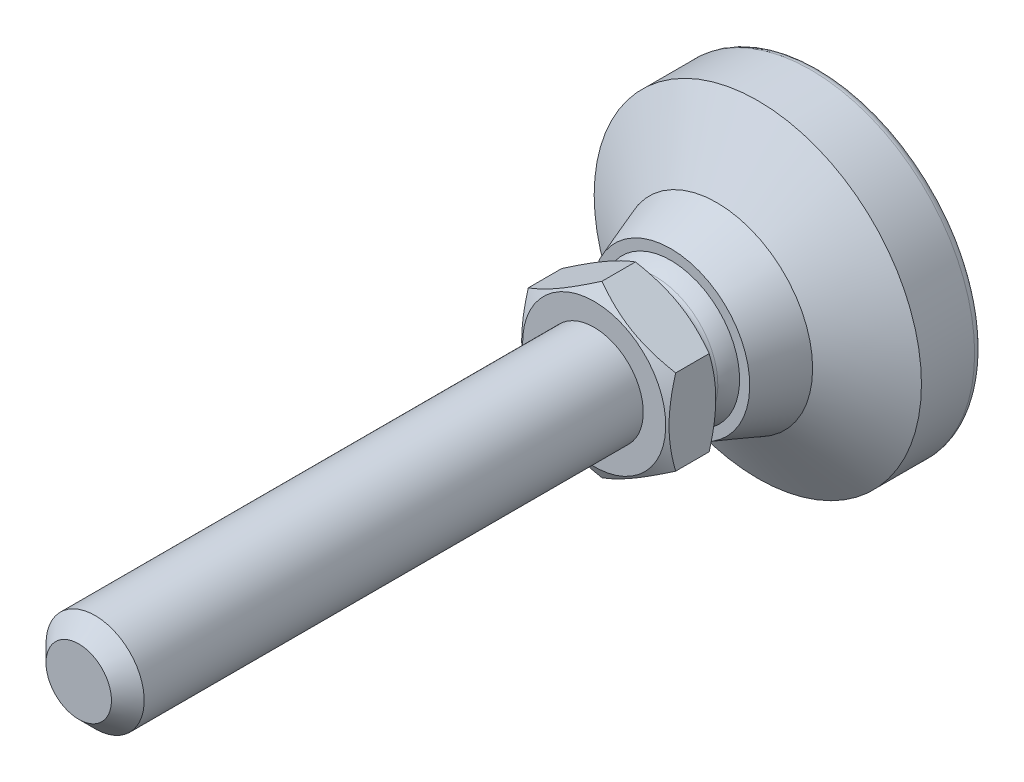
ISO-10303-21;
HEADER;
FILE_DESCRIPTION(('STEP AP214'),'2;1');
FILE_NAME('part.step','',(''),(''),'','','');
FILE_SCHEMA(('AUTOMOTIVE_DESIGN { 1 0 10303 214 1 1 1 1 }'));
ENDSEC;
DATA;
#1=APPLICATION_CONTEXT('core data for automotive mechanical design processes');
#2=APPLICATION_PROTOCOL_DEFINITION('international standard','automotive_design',2000,#1);
#3=PRODUCT_CONTEXT('',#1,'mechanical');
#4=PRODUCT('Part','Part','',(#3));
#5=PRODUCT_RELATED_PRODUCT_CATEGORY('part','',(#4));
#6=PRODUCT_DEFINITION_FORMATION('','',#4);
#7=PRODUCT_DEFINITION_CONTEXT('part definition',#1,'design');
#8=PRODUCT_DEFINITION('design','',#6,#7);
#9=PRODUCT_DEFINITION_SHAPE('','',#8);
#10=(LENGTH_UNIT() NAMED_UNIT(*) SI_UNIT(.MILLI.,.METRE.));
#11=(NAMED_UNIT(*) PLANE_ANGLE_UNIT() SI_UNIT($,.RADIAN.));
#12=(NAMED_UNIT(*) SI_UNIT($,.STERADIAN.) SOLID_ANGLE_UNIT());
#13=UNCERTAINTY_MEASURE_WITH_UNIT(LENGTH_MEASURE(1.E-05),#10,'distance_accuracy_value','');
#14=(GEOMETRIC_REPRESENTATION_CONTEXT(3) GLOBAL_UNCERTAINTY_ASSIGNED_CONTEXT((#13)) GLOBAL_UNIT_ASSIGNED_CONTEXT((#10,
#11,#12)) REPRESENTATION_CONTEXT('',''));
#15=CARTESIAN_POINT('',(0.,0.,0.));
#16=DIRECTION('',(0.,0.,1.));
#17=DIRECTION('',(1.,0.,0.));
#18=AXIS2_PLACEMENT_3D('',#15,#16,#17);
#19=CARTESIAN_POINT('',(-8.50000006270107,0.,21.4999999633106));
#20=DIRECTION('',(0.,0.,1.));
#21=DIRECTION('',(0.,-1.,0.));
#22=AXIS2_PLACEMENT_3D('',#19,#20,#21);
#23=PLANE('',#22);
#24=CARTESIAN_POINT('',(0.,0.,21.4999999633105));
#25=DIRECTION('',(0.,0.,-1.));
#26=DIRECTION('',(0.,1.,0.));
#27=AXIS2_PLACEMENT_3D('',#24,#25,#26);
#28=CIRCLE('',#27,8.75);
#29=CARTESIAN_POINT('',(0.,8.75,21.4999999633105));
#30=VERTEX_POINT('',#29);
#31=EDGE_CURVE('E296',#30,#30,#28,.T.);
#32=ORIENTED_EDGE('',*,*,#31,.T.);
#33=EDGE_LOOP('',(#32));
#34=FACE_BOUND('',#33,.T.);
#35=CARTESIAN_POINT('',(0.,0.,21.4999999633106));
#36=DIRECTION('',(0.,0.,-1.));
#37=DIRECTION('',(0.,1.,0.));
#38=AXIS2_PLACEMENT_3D('',#35,#36,#37);
#39=CIRCLE('',#38,8.50000006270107);
#40=CARTESIAN_POINT('',(0.,8.50000006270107,21.4999999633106));
#41=VERTEX_POINT('',#40);
#42=EDGE_CURVE('E73',#41,#41,#39,.T.);
#43=ORIENTED_EDGE('',*,*,#42,.F.);
#44=EDGE_LOOP('',(#43));
#45=FACE_BOUND('',#44,.T.);
#46=ADVANCED_FACE('F14',(#34,#45),#23,.F.);
#47=CARTESIAN_POINT('',(0.,0.,20.5000000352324));
#48=DIRECTION('',(0.,0.,-1.));
#49=DIRECTION('',(0.,1.,0.));
#50=AXIS2_PLACEMENT_3D('',#47,#48,#49);
#51=TOROIDAL_SURFACE('',#50,8.50000006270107,0.999999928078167);
#52=CARTESIAN_POINT('',(0.,0.,20.0101291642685));
#53=DIRECTION('',(0.,0.,-1.));
#54=DIRECTION('',(0.,1.,0.));
#55=AXIS2_PLACEMENT_3D('',#52,#53,#54);
#56=CIRCLE('',#55,7.62820514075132);
#57=CARTESIAN_POINT('',(-7.6282051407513,0.,20.0101291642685));
#58=VERTEX_POINT('',#57);
#59=EDGE_CURVE('E112',#58,#58,#56,.T.);
#60=ORIENTED_EDGE('',*,*,#59,.F.);
#61=EDGE_LOOP('',(#60));
#62=FACE_BOUND('',#61,.T.);
#63=ORIENTED_EDGE('',*,*,#42,.T.);
#64=EDGE_LOOP('',(#63));
#65=FACE_BOUND('',#64,.T.);
#66=ADVANCED_FACE('F229',(#62,#65),#51,.F.);
#67=CARTESIAN_POINT('',(0.,0.,15.723757));
#68=DIRECTION('',(0.,0.,-1.));
#69=DIRECTION('',(-1.,0.,0.));
#70=AXIS2_PLACEMENT_3D('',#67,#68,#69);
#71=SPHERICAL_SURFACE('',#70,8.75);
#72=CARTESIAN_POINT('',(0.,0.,18.135983));
#73=DIRECTION('',(0.,0.,-1.));
#74=DIRECTION('',(0.,1.,0.));
#75=AXIS2_PLACEMENT_3D('',#72,#73,#74);
#76=CIRCLE('',#75,8.4109253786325);
#77=CARTESIAN_POINT('',(-8.41092537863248,0.,18.135983));
#78=VERTEX_POINT('',#77);
#79=EDGE_CURVE('E109',#78,#78,#76,.T.);
#80=CARTESIAN_POINT('',(-8.41092537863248,0.,18.135983));
#81=CARTESIAN_POINT('',(-8.40507970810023,0.,18.1563656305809));
#82=CARTESIAN_POINT('',(-8.39915994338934,0.,18.1767270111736));
#83=CARTESIAN_POINT('',(-8.38717254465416,0.,18.2174061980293));
#84=CARTESIAN_POINT('',(-8.38110491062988,0.,18.2377240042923));
#85=CARTESIAN_POINT('',(-8.36882209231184,0.,18.2783149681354));
#86=CARTESIAN_POINT('',(-8.36260690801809,0.,18.2985881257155));
#87=CARTESIAN_POINT('',(-8.35002931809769,0.,18.3390887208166));
#88=CARTESIAN_POINT('',(-8.34366691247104,0.,18.3593161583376));
#89=CARTESIAN_POINT('',(-8.33079521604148,0.,18.3997242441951));
#90=CARTESIAN_POINT('',(-8.32428592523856,0.,18.4199048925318));
#91=CARTESIAN_POINT('',(-8.31112080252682,0.,18.4602183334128));
#92=CARTESIAN_POINT('',(-8.304464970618,0.,18.4803511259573));
#93=CARTESIAN_POINT('',(-8.29100711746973,0.,18.5205677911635));
#94=CARTESIAN_POINT('',(-8.28420509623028,0.,18.5406516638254));
#95=CARTESIAN_POINT('',(-8.27045522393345,0.,18.5807694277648));
#96=CARTESIAN_POINT('',(-8.26350737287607,0.,18.6008033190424));
#97=CARTESIAN_POINT('',(-8.24946620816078,0.,18.6408200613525));
#98=CARTESIAN_POINT('',(-8.24237289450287,0.,18.660802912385));
#99=CARTESIAN_POINT('',(-8.22804117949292,0.,18.7007165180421));
#100=CARTESIAN_POINT('',(-8.22080277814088,0.,18.7206472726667));
#101=CARTESIAN_POINT('',(-8.20618127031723,0.,18.7604556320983));
#102=CARTESIAN_POINT('',(-8.19879816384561,0.,18.7803332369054));
#103=CARTESIAN_POINT('',(-8.18388763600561,0.,18.8200342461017));
#104=CARTESIAN_POINT('',(-8.17636021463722,0.,18.839857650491));
#105=CARTESIAN_POINT('',(-8.16116145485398,0.,18.8794492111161));
#106=CARTESIAN_POINT('',(-8.15349011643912,0.,18.8992173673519));
#107=CARTESIAN_POINT('',(-8.1380039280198,0.,18.9386973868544));
#108=CARTESIAN_POINT('',(-8.13018907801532,0.,18.9584092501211));
#109=CARTESIAN_POINT('',(-8.11441627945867,0.,18.9977756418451));
#110=CARTESIAN_POINT('',(-8.10645833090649,0.,19.0174301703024));
#111=CARTESIAN_POINT('',(-8.09039975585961,0.,19.0566808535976));
#112=CARTESIAN_POINT('',(-8.08229912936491,0.,19.0762770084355));
#113=CARTESIAN_POINT('',(-8.06595562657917,0.,19.1154099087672));
#114=CARTESIAN_POINT('',(-8.05771275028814,0.,19.1349466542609));
#115=CARTESIAN_POINT('',(-8.04108518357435,0.,19.1739597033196));
#116=CARTESIAN_POINT('',(-8.03270049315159,0.,19.1934360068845));
#117=CARTESIAN_POINT('',(-8.0157897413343,0.,19.2323271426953));
#118=CARTESIAN_POINT('',(-8.00726367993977,0.,19.2517419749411));
#119=CARTESIAN_POINT('',(-7.99007063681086,0.,19.2905091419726));
#120=CARTESIAN_POINT('',(-7.98140365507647,0.,19.3098614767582));
#121=CARTESIAN_POINT('',(-7.96392922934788,0.,19.3485026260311));
#122=CARTESIAN_POINT('',(-7.95512178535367,0.,19.3677914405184));
#123=CARTESIAN_POINT('',(-7.9373669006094,0.,19.4063045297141));
#124=CARTESIAN_POINT('',(-7.92841945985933,0.,19.4255288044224));
#125=CARTESIAN_POINT('',(-7.91038505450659,0.,19.4639117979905));
#126=CARTESIAN_POINT('',(-7.90129808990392,0.,19.4830705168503));
#127=CARTESIAN_POINT('',(-7.88298511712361,0.,19.5213213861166));
#128=CARTESIAN_POINT('',(-7.87375910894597,0.,19.540413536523));
#129=CARTESIAN_POINT('',(-7.85516853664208,0.,19.5785302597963));
#130=CARTESIAN_POINT('',(-7.84580397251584,0.,19.5975548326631));
#131=CARTESIAN_POINT('',(-7.826936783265,0.,19.6355353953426));
#132=CARTESIAN_POINT('',(-7.8174341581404,0.,19.6544913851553));
#133=CARTESIAN_POINT('',(-7.79829134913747,0.,19.6923337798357));
#134=CARTESIAN_POINT('',(-7.78865116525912,0.,19.7112201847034));
#135=CARTESIAN_POINT('',(-7.76923374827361,0.,19.7489224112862));
#136=CARTESIAN_POINT('',(-7.75945651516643,0.,19.7677382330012));
#137=CARTESIAN_POINT('',(-7.73976551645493,0.,19.8052982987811));
#138=CARTESIAN_POINT('',(-7.72985175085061,0.,19.824042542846));
#139=CARTESIAN_POINT('',(-7.7098882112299,0.,19.8614584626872));
#140=CARTESIAN_POINT('',(-7.69983843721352,0.,19.8801301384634));
#141=CARTESIAN_POINT('',(-7.67960341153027,0.,19.9173999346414));
#142=CARTESIAN_POINT('',(-7.6694181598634,0.,19.9359980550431));
#143=CARTESIAN_POINT('',(-7.6489127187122,0.,19.9731197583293));
#144=CARTESIAN_POINT('',(-7.63859252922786,0.,19.9916433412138));
#145=CARTESIAN_POINT('',(-7.6282051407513,0.,20.0101291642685));
#146=B_SPLINE_CURVE_WITH_KNOTS('',3,(#80,#81,#82,#83,#84,#85,#86,#87,#88,#89,#90,#91,#92,#93,
#94,#95,#96,#97,#98,#99,#100,#101,#102,#103,#104,#105,#106,#107,#108,#109,#110,#111,#112,#113,
#114,#115,#116,#117,#118,#119,#120,#121,#122,#123,#124,#125,#126,#127,#128,#129,#130,#131,#132,
#133,#134,#135,#136,#137,#138,#139,#140,#141,#142,#143,#144,#145),.UNSPECIFIED.,.F.,.F.,(4,2,2,
2,2,2,2,2,2,2,2,2,2,2,2,2,2,2,2,2,2,2,2,2,2,2,2,2,2,2,2,2,4),(0.,0.0636128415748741,
0.127225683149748,0.190838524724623,0.254451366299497,0.31806420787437,0.381677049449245,
0.445289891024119,0.508902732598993,0.572515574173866,0.636128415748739,0.699741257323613,
0.763354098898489,0.826966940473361,0.890579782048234,0.954192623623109,1.01780546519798,
1.08141830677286,1.14503114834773,1.2086439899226,1.27225683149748,1.33586967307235,
1.39948251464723,1.4630953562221,1.52670819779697,1.59032103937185,1.65393388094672,
1.7175467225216,1.78115956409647,1.84477240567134,1.90838524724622,1.97199808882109,
2.03561093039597),.UNSPECIFIED.);
#147=EDGE_CURVE('BSEAM225',#78,#58,#146,.T.);
#148=ORIENTED_EDGE('',*,*,#79,.F.);
#149=ORIENTED_EDGE('',*,*,#59,.T.);
#150=ORIENTED_EDGE('',*,*,#147,.T.);
#151=ORIENTED_EDGE('',*,*,#147,.F.);
#152=EDGE_LOOP('',(#148,#150,#149,#151));
#153=FACE_BOUND('',#152,.T.);
#154=ADVANCED_FACE('F225',(#153),#71,.T.);
#155=CARTESIAN_POINT('',(-8.4109253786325,0.,18.135983));
#156=DIRECTION('',(0.,0.,-1.));
#157=DIRECTION('',(0.,1.,0.));
#158=AXIS2_PLACEMENT_3D('',#155,#156,#157);
#159=PLANE('',#158);
#160=CARTESIAN_POINT('',(0.,0.,18.135983));
#161=DIRECTION('',(0.,0.,-1.));
#162=DIRECTION('',(0.,1.,0.));
#163=AXIS2_PLACEMENT_3D('',#160,#161,#162);
#164=CIRCLE('',#163,9.649999);
#165=CARTESIAN_POINT('',(0.,9.649999,18.135983));
#166=VERTEX_POINT('',#165);
#167=EDGE_CURVE('E106',#166,#166,#164,.T.);
#168=ORIENTED_EDGE('',*,*,#167,.F.);
#169=EDGE_LOOP('',(#168));
#170=FACE_BOUND('',#169,.T.);
#171=ORIENTED_EDGE('',*,*,#79,.T.);
#172=EDGE_LOOP('',(#171));
#173=FACE_BOUND('',#172,.T.);
#174=ADVANCED_FACE('F221',(#170,#173),#159,.F.);
#175=CARTESIAN_POINT('',(0.,0.,18.135983));
#176=DIRECTION('',(0.,0.,-1.));
#177=DIRECTION('',(0.,1.,0.));
#178=AXIS2_PLACEMENT_3D('',#175,#176,#177);
#179=CONICAL_SURFACE('',#178,9.649999,0.349065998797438);
#180=CARTESIAN_POINT('',(0.,0.,12.5));
#181=DIRECTION('',(0.,0.,-1.));
#182=DIRECTION('',(0.,1.,0.));
#183=AXIS2_PLACEMENT_3D('',#180,#181,#182);
#184=CIRCLE('',#183,11.70133);
#185=CARTESIAN_POINT('',(0.,11.70133,12.5));
#186=VERTEX_POINT('',#185);
#187=EDGE_CURVE('E103',#186,#186,#184,.T.);
#188=ORIENTED_EDGE('',*,*,#187,.F.);
#189=EDGE_LOOP('',(#188));
#190=FACE_BOUND('',#189,.T.);
#191=ORIENTED_EDGE('',*,*,#167,.T.);
#192=EDGE_LOOP('',(#191));
#193=FACE_BOUND('',#192,.T.);
#194=ADVANCED_FACE('F217',(#190,#193),#179,.T.);
#195=CARTESIAN_POINT('',(0.,0.,12.5));
#196=DIRECTION('',(0.,0.,-1.));
#197=DIRECTION('',(0.,1.,0.));
#198=AXIS2_PLACEMENT_3D('',#195,#196,#197);
#199=CONICAL_SURFACE('',#198,11.70133,1.02853608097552);
#200=CARTESIAN_POINT('',(0.,0.,7.5));
#201=DIRECTION('',(0.,0.,-1.));
#202=DIRECTION('',(0.,1.,0.));
#203=AXIS2_PLACEMENT_3D('',#200,#201,#202);
#204=CIRCLE('',#203,20.);
#205=CARTESIAN_POINT('',(0.,20.,7.5));
#206=VERTEX_POINT('',#205);
#207=EDGE_CURVE('E100',#206,#206,#204,.T.);
#208=ORIENTED_EDGE('',*,*,#207,.F.);
#209=EDGE_LOOP('',(#208));
#210=FACE_BOUND('',#209,.T.);
#211=ORIENTED_EDGE('',*,*,#187,.T.);
#212=EDGE_LOOP('',(#211));
#213=FACE_BOUND('',#212,.T.);
#214=ADVANCED_FACE('F213',(#210,#213),#199,.T.);
#215=CARTESIAN_POINT('',(0.,0.,0.));
#216=DIRECTION('',(0.,0.,-1.));
#217=DIRECTION('',(0.,1.,0.));
#218=AXIS2_PLACEMENT_3D('',#215,#216,#217);
#219=CYLINDRICAL_SURFACE('',#218,20.);
#220=CARTESIAN_POINT('',(0.,0.,1.));
#221=DIRECTION('',(0.,0.,-1.));
#222=DIRECTION('',(0.,1.,0.));
#223=AXIS2_PLACEMENT_3D('',#220,#221,#222);
#224=CIRCLE('',#223,20.);
#225=CARTESIAN_POINT('',(0.,20.,1.));
#226=VERTEX_POINT('',#225);
#227=EDGE_CURVE('E97',#226,#226,#224,.T.);
#228=ORIENTED_EDGE('',*,*,#227,.F.);
#229=EDGE_LOOP('',(#228));
#230=FACE_BOUND('',#229,.T.);
#231=ORIENTED_EDGE('',*,*,#207,.T.);
#232=EDGE_LOOP('',(#231));
#233=FACE_BOUND('',#232,.T.);
#234=ADVANCED_FACE('F209',(#230,#233),#219,.T.);
#235=CARTESIAN_POINT('',(0.,0.,1.));
#236=DIRECTION('',(0.,0.,-1.));
#237=DIRECTION('',(0.,1.,0.));
#238=AXIS2_PLACEMENT_3D('',#235,#236,#237);
#239=TOROIDAL_SURFACE('',#238,19.,1.);
#240=CARTESIAN_POINT('',(0.,0.,0.));
#241=DIRECTION('',(0.,0.,-1.));
#242=DIRECTION('',(0.,1.,0.));
#243=AXIS2_PLACEMENT_3D('',#240,#241,#242);
#244=CIRCLE('',#243,19.);
#245=CARTESIAN_POINT('',(0.,19.,0.));
#246=VERTEX_POINT('',#245);
#247=EDGE_CURVE('E94',#246,#246,#244,.T.);
#248=ORIENTED_EDGE('',*,*,#247,.F.);
#249=EDGE_LOOP('',(#248));
#250=FACE_BOUND('',#249,.T.);
#251=ORIENTED_EDGE('',*,*,#227,.T.);
#252=EDGE_LOOP('',(#251));
#253=FACE_BOUND('',#252,.T.);
#254=ADVANCED_FACE('F205',(#250,#253),#239,.T.);
#255=CARTESIAN_POINT('',(-19.,0.,0.));
#256=DIRECTION('',(0.,0.,1.));
#257=DIRECTION('',(0.,-1.,0.));
#258=AXIS2_PLACEMENT_3D('',#255,#256,#257);
#259=PLANE('',#258);
#260=ORIENTED_EDGE('',*,*,#247,.T.);
#261=EDGE_LOOP('',(#260));
#262=FACE_BOUND('',#261,.T.);
#263=ADVANCED_FACE('F132',(#262),#259,.F.);
#264=CARTESIAN_POINT('',(0.,0.,23.4448785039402));
#265=DIRECTION('',(0.,0.,1.));
#266=DIRECTION('',(0.,-1.,0.));
#267=AXIS2_PLACEMENT_3D('',#264,#265,#266);
#268=CONICAL_SURFACE('',#267,12.1186284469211,1.0471975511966);
#269=CARTESIAN_POINT('',(0.000200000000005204,-10.4000990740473,22.4526851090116));
#270=CARTESIAN_POINT('',(-0.197753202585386,-10.2858107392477,22.3867041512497));
#271=CARTESIAN_POINT('',(-0.396478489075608,-10.1710766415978,22.3237170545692));
#272=CARTESIAN_POINT('',(-0.795542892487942,-9.9406767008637,22.2045566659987));
#273=CARTESIAN_POINT('',(-0.995882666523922,-9.82501047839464,22.148386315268));
#274=CARTESIAN_POINT('',(-1.39854780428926,-9.59253165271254,22.0436208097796));
#275=CARTESIAN_POINT('',(-1.60087672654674,-9.47571699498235,21.9950437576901));
#276=CARTESIAN_POINT('',(-2.00691067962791,-9.2412931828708,21.906516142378));
#277=CARTESIAN_POINT('',(-2.21061542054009,-9.12368419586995,21.8665638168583));
#278=CARTESIAN_POINT('',(-2.61423624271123,-8.89065360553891,21.7969714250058));
#279=CARTESIAN_POINT('',(-2.81412251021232,-8.77524921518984,21.7671022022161));
#280=CARTESIAN_POINT('',(-3.21478942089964,-8.54392406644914,21.717021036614));
#281=CARTESIAN_POINT('',(-3.41556998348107,-8.42800335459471,21.6968082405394));
#282=CARTESIAN_POINT('',(-3.81747936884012,-8.19596086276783,21.66654481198));
#283=CARTESIAN_POINT('',(-4.01860753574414,-8.07983946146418,21.6564826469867));
#284=CARTESIAN_POINT('',(-4.4210489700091,-7.84748979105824,21.6467381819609));
#285=CARTESIAN_POINT('',(-4.62236223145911,-7.73126152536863,21.6470555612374));
#286=CARTESIAN_POINT('',(-4.99872349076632,-7.51396925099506,21.6573476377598));
#287=CARTESIAN_POINT('',(-5.17379802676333,-7.41288992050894,21.6660668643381));
#288=CARTESIAN_POINT('',(-5.52353701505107,-7.21096802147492,21.6911860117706));
#289=CARTESIAN_POINT('',(-5.69820143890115,-7.11012546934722,21.7075864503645));
#290=CARTESIAN_POINT('',(-6.2215185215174,-6.8079882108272,21.767921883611));
#291=CARTESIAN_POINT('',(-6.56924487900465,-6.60722830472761,21.822983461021));
#292=CARTESIAN_POINT('',(-7.26838615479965,-6.20357890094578,21.960638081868));
#293=CARTESIAN_POINT('',(-7.6197118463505,-6.00074091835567,22.0438146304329));
#294=CARTESIAN_POINT('',(-8.31712409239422,-5.59808977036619,22.2325909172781));
#295=CARTESIAN_POINT('',(-8.66321957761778,-5.39827144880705,22.3381463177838));
#296=CARTESIAN_POINT('',(-9.00685,-5.19987633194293,22.4526851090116));
#297=B_SPLINE_CURVE_WITH_KNOTS('',3,(#269,#270,#271,#272,#273,#274,#275,#276,#277,#278,#279,
#280,#281,#282,#283,#284,#285,#286,#287,#288,#289,#290,#291,#292,#293,#294,#295,#296),
.UNSPECIFIED.,.F.,.F.,(4,2,2,2,2,2,2,2,2,2,2,2,2,4),(0.,0.713746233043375,1.42779933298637,
2.1435296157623,2.85911351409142,3.55712384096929,4.2550724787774,4.95222725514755,
5.64936049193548,6.25624894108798,6.86317830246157,8.07790154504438,9.31956468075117,
10.5587904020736),.UNSPECIFIED.);
#298=CARTESIAN_POINT('',(0.,-10.3999836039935,22.4526184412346));
#299=VERTEX_POINT('',#298);
#300=CARTESIAN_POINT('',(-9.00665,-5.19999180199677,22.4526184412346));
#301=VERTEX_POINT('',#300);
#302=EDGE_CURVE('E69',#299,#301,#297,.T.);
#303=ORIENTED_EDGE('',*,*,#302,.T.);
#304=CARTESIAN_POINT('',(-9.00665,13.9085652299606,26.0149318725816));
#305=CARTESIAN_POINT('',(-9.00665,13.712128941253,25.9197378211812));
#306=CARTESIAN_POINT('',(-9.00665,13.5154605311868,25.825022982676));
#307=CARTESIAN_POINT('',(-9.00665,13.1216110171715,25.6366603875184));
#308=CARTESIAN_POINT('',(-9.00665,12.9244299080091,25.5430126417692));
#309=CARTESIAN_POINT('',(-9.00665,12.331991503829,25.2638079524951));
#310=CARTESIAN_POINT('',(-9.00665,11.9358981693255,25.0800182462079));
#311=CARTESIAN_POINT('',(-9.00665,11.138856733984,24.717271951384));
#312=CARTESIAN_POINT('',(-9.00665,10.7378939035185,24.5383476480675));
#313=CARTESIAN_POINT('',(-9.00665,9.93275898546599,24.1878979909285));
#314=CARTESIAN_POINT('',(-9.00665,9.52858705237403,24.016372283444));
#315=CARTESIAN_POINT('',(-9.00665,8.70357471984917,23.6774145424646));
#316=CARTESIAN_POINT('',(-9.00665,8.28261055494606,23.5102820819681));
#317=CARTESIAN_POINT('',(-9.00665,7.43573645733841,23.1888102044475));
#318=CARTESIAN_POINT('',(-9.00665,7.00982597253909,23.0344722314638));
#319=CARTESIAN_POINT('',(-9.00665,6.15319295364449,22.7426852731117));
#320=CARTESIAN_POINT('',(-9.00665,5.72248237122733,22.6052015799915));
#321=CARTESIAN_POINT('',(-9.00665,4.85489907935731,22.3515718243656));
#322=CARTESIAN_POINT('',(-9.00665,4.41802837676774,22.2354189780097));
#323=CARTESIAN_POINT('',(-9.00665,3.54021710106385,22.0306864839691));
#324=CARTESIAN_POINT('',(-9.00665,3.09931183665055,21.9419595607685));
#325=CARTESIAN_POINT('',(-9.00665,2.43398675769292,21.8333093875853));
#326=CARTESIAN_POINT('',(-9.00665,2.21153373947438,21.8011645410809));
#327=CARTESIAN_POINT('',(-9.00665,1.76554225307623,21.7456534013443));
#328=CARTESIAN_POINT('',(-9.00665,1.54200389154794,21.7222862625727));
#329=CARTESIAN_POINT('',(-9.00665,1.09703528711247,21.6850860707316));
#330=CARTESIAN_POINT('',(-9.00665,0.875615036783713,21.6711339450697));
#331=CARTESIAN_POINT('',(-9.00665,0.432383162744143,21.6526014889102));
#332=CARTESIAN_POINT('',(-9.00665,0.210571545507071,21.6480210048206));
#333=CARTESIAN_POINT('',(-9.00665,-0.233047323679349,21.6483409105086));
#334=CARTESIAN_POINT('',(-9.00665,-0.454854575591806,21.6532413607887));
#335=CARTESIAN_POINT('',(-9.00665,-0.898067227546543,21.6724045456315));
#336=CARTESIAN_POINT('',(-9.00665,-1.11947260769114,21.686667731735));
#337=CARTESIAN_POINT('',(-9.00665,-1.65338639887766,21.7320521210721));
#338=CARTESIAN_POINT('',(-9.00665,-1.96551532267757,21.7677159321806));
#339=CARTESIAN_POINT('',(-9.00665,-2.58741926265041,21.8556947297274));
#340=CARTESIAN_POINT('',(-9.00665,-2.89719394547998,21.9080120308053));
#341=CARTESIAN_POINT('',(-9.00665,-3.51410694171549,22.0274365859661));
#342=CARTESIAN_POINT('',(-9.00665,-3.82124296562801,22.0945555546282));
#343=CARTESIAN_POINT('',(-9.00665,-4.43241585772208,22.2415387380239));
#344=CARTESIAN_POINT('',(-9.00665,-4.73645277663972,22.3214027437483));
#345=CARTESIAN_POINT('',(-9.00665,-5.34807693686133,22.4938136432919));
#346=CARTESIAN_POINT('',(-9.00665,-5.65559624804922,22.5865998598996));
#347=CARTESIAN_POINT('',(-9.00665,-6.26760483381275,22.7816280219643));
#348=CARTESIAN_POINT('',(-9.00665,-6.57209408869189,22.883870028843));
#349=CARTESIAN_POINT('',(-9.00665,-7.17819533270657,23.0961978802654));
#350=CARTESIAN_POINT('',(-9.00665,-7.47980827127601,23.2062810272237));
#351=CARTESIAN_POINT('',(-9.00665,-8.08054368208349,23.4330089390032));
#352=CARTESIAN_POINT('',(-9.00665,-8.37966618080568,23.5496536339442));
#353=CARTESIAN_POINT('',(-9.00665,-9.07444152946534,23.8279659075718));
#354=CARTESIAN_POINT('',(-9.00665,-9.46924614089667,23.9917475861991));
#355=CARTESIAN_POINT('',(-9.00665,-10.2555912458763,24.3269893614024));
#356=CARTESIAN_POINT('',(-9.00665,-10.6471315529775,24.4984498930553));
#357=CARTESIAN_POINT('',(-9.00665,-11.4275415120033,24.8475420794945));
#358=CARTESIAN_POINT('',(-9.00665,-11.8164105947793,25.0251750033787));
#359=CARTESIAN_POINT('',(-9.00665,-12.5918335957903,25.3853928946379));
#360=CARTESIAN_POINT('',(-9.00665,-12.9783875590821,25.5679777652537));
#361=CARTESIAN_POINT('',(-9.00665,-13.7499550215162,25.9373801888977));
#362=CARTESIAN_POINT('',(-9.00665,-14.1349665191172,26.1242019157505));
#363=CARTESIAN_POINT('',(-9.00665,-14.9033503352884,26.5011894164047));
#364=CARTESIAN_POINT('',(-9.00665,-15.2867226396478,26.6913552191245));
#365=CARTESIAN_POINT('',(-9.00665,-16.4346701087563,27.2659479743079));
#366=CARTESIAN_POINT('',(-9.00665,-17.1971719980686,27.6545166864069));
#367=CARTESIAN_POINT('',(-9.00665,-18.6561944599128,28.4075032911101));
#368=CARTESIAN_POINT('',(-9.00665,-19.3530313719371,28.7713109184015));
#369=CARTESIAN_POINT('',(-9.00665,-20.7441040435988,29.5039169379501));
#370=CARTESIAN_POINT('',(-9.00665,-21.4383397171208,29.872715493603));
#371=CARTESIAN_POINT('',(-9.00665,-22.823127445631,30.6132448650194));
#372=CARTESIAN_POINT('',(-9.00665,-23.5136843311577,30.9849666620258));
#373=CARTESIAN_POINT('',(-9.00665,-24.8931283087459,31.7314107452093));
#374=CARTESIAN_POINT('',(-9.00665,-25.5820154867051,32.1061328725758));
#375=CARTESIAN_POINT('',(-9.00665,-26.2702848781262,32.4819787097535));
#376=B_SPLINE_CURVE_WITH_KNOTS('',3,(#304,#305,#306,#307,#308,#309,#310,#311,#312,#313,#314,
#315,#316,#317,#318,#319,#320,#321,#322,#323,#324,#325,#326,#327,#328,#329,#330,#331,#332,#333,
#334,#335,#336,#337,#338,#339,#340,#341,#342,#343,#344,#345,#346,#347,#348,#349,#350,#351,#352,
#353,#354,#355,#356,#357,#358,#359,#360,#361,#362,#363,#364,#365,#366,#367,#368,#369,#370,#371,
#372,#373,#374,#375),.UNSPECIFIED.,.F.,.F.,(4,2,2,2,2,2,2,2,2,2,2,2,2,2,2,2,2,2,2,2,2,2,2,2,2,2,
2,2,2,2,2,2,2,2,2,4),(0.,0.654859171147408,1.30972502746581,2.61965364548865,3.93681426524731,
5.25391185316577,6.61253564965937,7.97131257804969,9.32724264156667,10.6827407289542,
12.0308280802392,12.7049726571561,13.3790522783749,14.0444384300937,14.7098136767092,
15.3751931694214,16.0406047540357,16.9825615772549,17.9246493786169,18.8674854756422,
19.8103061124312,20.7737612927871,21.7372227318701,22.7003542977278,23.6634756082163,
24.9456520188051,26.227901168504,27.510415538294,28.7929048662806,30.0767177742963,
31.3605417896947,33.9278695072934,36.2861182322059,38.6444443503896,40.9971823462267,
43.3497966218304),.UNSPECIFIED.);
#377=CARTESIAN_POINT('',(-9.00665,5.19999180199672,22.4526184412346));
#378=VERTEX_POINT('',#377);
#379=EDGE_CURVE('E79',#301,#378,#376,.F.);
#380=ORIENTED_EDGE('',*,*,#379,.T.);
#381=CARTESIAN_POINT('',(-9.00685,5.19987633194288,22.4526851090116));
#382=CARTESIAN_POINT('',(-8.80889679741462,5.3141646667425,22.3867041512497));
#383=CARTESIAN_POINT('',(-8.6101715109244,5.42889876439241,22.3237170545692));
#384=CARTESIAN_POINT('',(-8.21110710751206,5.65929870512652,22.2045566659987));
#385=CARTESIAN_POINT('',(-8.01076733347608,5.77496492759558,22.148386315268));
#386=CARTESIAN_POINT('',(-7.60810219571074,6.00744375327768,22.0436208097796));
#387=CARTESIAN_POINT('',(-7.40577327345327,6.12425841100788,21.9950437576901));
#388=CARTESIAN_POINT('',(-6.99973932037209,6.35868222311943,21.906516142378));
#389=CARTESIAN_POINT('',(-6.79603457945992,6.47629121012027,21.8665638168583));
#390=CARTESIAN_POINT('',(-6.39241375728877,6.70932180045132,21.7969714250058));
#391=CARTESIAN_POINT('',(-6.19252748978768,6.82472619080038,21.7671022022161));
#392=CARTESIAN_POINT('',(-5.79186057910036,7.05605133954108,21.7170210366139));
#393=CARTESIAN_POINT('',(-5.59108001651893,7.17197205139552,21.6968082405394));
#394=CARTESIAN_POINT('',(-5.18917063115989,7.4040145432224,21.6665448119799));
#395=CARTESIAN_POINT('',(-4.98804246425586,7.52013594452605,21.6564826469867));
#396=CARTESIAN_POINT('',(-4.5856010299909,7.75248561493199,21.6467381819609));
#397=CARTESIAN_POINT('',(-4.3842877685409,7.86871388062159,21.6470555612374));
#398=CARTESIAN_POINT('',(-4.00792650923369,8.08600615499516,21.6573476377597));
#399=CARTESIAN_POINT('',(-3.83285197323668,8.18708548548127,21.666066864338));
#400=CARTESIAN_POINT('',(-3.48311298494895,8.3890073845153,21.6911860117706));
#401=CARTESIAN_POINT('',(-3.30844856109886,8.489849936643,21.7075864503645));
#402=CARTESIAN_POINT('',(-2.78513147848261,8.79198719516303,21.7679218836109));
#403=CARTESIAN_POINT('',(-2.43740512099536,8.99274710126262,21.822983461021));
#404=CARTESIAN_POINT('',(-1.73826384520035,9.39639650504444,21.960638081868));
#405=CARTESIAN_POINT('',(-1.38693815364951,9.59923448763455,22.0438146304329));
#406=CARTESIAN_POINT('',(-0.68952590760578,10.001885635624,22.232590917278));
#407=CARTESIAN_POINT('',(-0.343430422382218,10.2017039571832,22.3381463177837));
#408=CARTESIAN_POINT('',(0.000200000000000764,10.4000990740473,22.4526851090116));
#409=B_SPLINE_CURVE_WITH_KNOTS('',3,(#381,#382,#383,#384,#385,#386,#387,#388,#389,#390,#391,
#392,#393,#394,#395,#396,#397,#398,#399,#400,#401,#402,#403,#404,#405,#406,#407,#408),
.UNSPECIFIED.,.F.,.F.,(4,2,2,2,2,2,2,2,2,2,2,2,2,4),(0.,0.713746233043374,1.42779933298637,
2.1435296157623,2.85911351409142,3.55712384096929,4.2550724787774,4.95222725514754,
5.64936049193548,6.25624894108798,6.86317830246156,8.07790154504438,9.31956468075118,
10.5587904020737),.UNSPECIFIED.);
#410=CARTESIAN_POINT('',(0.,10.3999836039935,22.4526184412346));
#411=VERTEX_POINT('',#410);
#412=EDGE_CURVE('E157',#378,#411,#409,.T.);
#413=ORIENTED_EDGE('',*,*,#412,.T.);
#414=CARTESIAN_POINT('',(-0.000199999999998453,10.4000990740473,22.4526851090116));
#415=CARTESIAN_POINT('',(0.197753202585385,10.2858107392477,22.3867041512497));
#416=CARTESIAN_POINT('',(0.396478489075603,10.1710766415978,22.3237170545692));
#417=CARTESIAN_POINT('',(0.795542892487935,9.94067670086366,22.2045566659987));
#418=CARTESIAN_POINT('',(0.995882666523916,9.8250104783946,22.1483863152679));
#419=CARTESIAN_POINT('',(1.39854780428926,9.5925316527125,22.0436208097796));
#420=CARTESIAN_POINT('',(1.60087672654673,9.4757169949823,21.9950437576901));
#421=CARTESIAN_POINT('',(2.00691067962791,9.24129318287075,21.906516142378));
#422=CARTESIAN_POINT('',(2.21061542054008,9.1236841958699,21.8665638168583));
#423=CARTESIAN_POINT('',(2.61423624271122,8.89065360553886,21.7969714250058));
#424=CARTESIAN_POINT('',(2.81412251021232,8.77524921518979,21.7671022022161));
#425=CARTESIAN_POINT('',(3.21478942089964,8.54392406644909,21.7170210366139));
#426=CARTESIAN_POINT('',(3.41556998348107,8.42800335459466,21.6968082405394));
#427=CARTESIAN_POINT('',(3.81747936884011,8.19596086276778,21.6665448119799));
#428=CARTESIAN_POINT('',(4.01860753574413,8.07983946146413,21.6564826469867));
#429=CARTESIAN_POINT('',(4.4210489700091,7.84748979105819,21.6467381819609));
#430=CARTESIAN_POINT('',(4.6223622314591,7.73126152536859,21.6470555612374));
#431=CARTESIAN_POINT('',(4.99872349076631,7.51396925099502,21.6573476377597));
#432=CARTESIAN_POINT('',(5.17379802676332,7.4128899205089,21.6660668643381));
#433=CARTESIAN_POINT('',(5.52353701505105,7.21096802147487,21.6911860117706));
#434=CARTESIAN_POINT('',(5.69820143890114,7.11012546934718,21.7075864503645));
#435=CARTESIAN_POINT('',(6.22151852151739,6.80798821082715,21.767921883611));
#436=CARTESIAN_POINT('',(6.56924487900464,6.60722830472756,21.822983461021));
#437=CARTESIAN_POINT('',(7.26838615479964,6.20357890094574,21.960638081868));
#438=CARTESIAN_POINT('',(7.61971184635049,6.00074091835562,22.0438146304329));
#439=CARTESIAN_POINT('',(8.31712409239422,5.59808977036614,22.232590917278));
#440=CARTESIAN_POINT('',(8.66321957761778,5.398271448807,22.3381463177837));
#441=CARTESIAN_POINT('',(9.00685,5.19987633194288,22.4526851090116));
#442=B_SPLINE_CURVE_WITH_KNOTS('',3,(#414,#415,#416,#417,#418,#419,#420,#421,#422,#423,#424,
#425,#426,#427,#428,#429,#430,#431,#432,#433,#434,#435,#436,#437,#438,#439,#440,#441),
.UNSPECIFIED.,.F.,.F.,(4,2,2,2,2,2,2,2,2,2,2,2,2,4),(0.,0.713746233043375,1.42779933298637,
2.1435296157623,2.85911351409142,3.55712384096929,4.2550724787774,4.95222725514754,
5.64936049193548,6.25624894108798,6.86317830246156,8.07790154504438,9.31956468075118,
10.5587904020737),.UNSPECIFIED.);
#443=CARTESIAN_POINT('',(9.00665,5.19999180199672,22.4526184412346));
#444=VERTEX_POINT('',#443);
#445=EDGE_CURVE('E150',#411,#444,#442,.T.);
#446=ORIENTED_EDGE('',*,*,#445,.T.);
#447=CARTESIAN_POINT('',(9.00665,13.9085652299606,26.0149318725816));
#448=CARTESIAN_POINT('',(9.00665,13.7121289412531,25.9197378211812));
#449=CARTESIAN_POINT('',(9.00665,13.5154605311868,25.825022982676));
#450=CARTESIAN_POINT('',(9.00665,13.1216110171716,25.6366603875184));
#451=CARTESIAN_POINT('',(9.00665,12.9244299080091,25.5430126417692));
#452=CARTESIAN_POINT('',(9.00665,12.331991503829,25.2638079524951));
#453=CARTESIAN_POINT('',(9.00665,11.9358981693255,25.0800182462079));
#454=CARTESIAN_POINT('',(9.00665,11.138856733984,24.717271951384));
#455=CARTESIAN_POINT('',(9.00665,10.7378939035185,24.5383476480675));
#456=CARTESIAN_POINT('',(9.00665,9.93275898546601,24.1878979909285));
#457=CARTESIAN_POINT('',(9.00665,9.52858705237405,24.016372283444));
#458=CARTESIAN_POINT('',(9.00665,8.70357471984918,23.6774145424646));
#459=CARTESIAN_POINT('',(9.00665,8.28261055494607,23.5102820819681));
#460=CARTESIAN_POINT('',(9.00665,7.43573645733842,23.1888102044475));
#461=CARTESIAN_POINT('',(9.00665,7.0098259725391,23.0344722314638));
#462=CARTESIAN_POINT('',(9.00665,6.15319295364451,22.7426852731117));
#463=CARTESIAN_POINT('',(9.00665,5.72248237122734,22.6052015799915));
#464=CARTESIAN_POINT('',(9.00665,4.85489907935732,22.3515718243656));
#465=CARTESIAN_POINT('',(9.00665,4.41802837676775,22.2354189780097));
#466=CARTESIAN_POINT('',(9.00665,3.54021710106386,22.0306864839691));
#467=CARTESIAN_POINT('',(9.00665,3.09931183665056,21.9419595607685));
#468=CARTESIAN_POINT('',(9.00665,2.43398675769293,21.8333093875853));
#469=CARTESIAN_POINT('',(9.00665,2.21153373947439,21.8011645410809));
#470=CARTESIAN_POINT('',(9.00665,1.76554225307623,21.7456534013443));
#471=CARTESIAN_POINT('',(9.00665,1.54200389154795,21.7222862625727));
#472=CARTESIAN_POINT('',(9.00665,1.09703528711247,21.6850860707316));
#473=CARTESIAN_POINT('',(9.00665,0.875615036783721,21.6711339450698));
#474=CARTESIAN_POINT('',(9.00665,0.43238316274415,21.6526014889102));
#475=CARTESIAN_POINT('',(9.00665,0.210571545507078,21.6480210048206));
#476=CARTESIAN_POINT('',(9.00665,-0.233047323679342,21.6483409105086));
#477=CARTESIAN_POINT('',(9.00665,-0.4548545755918,21.6532413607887));
#478=CARTESIAN_POINT('',(9.00665,-0.898067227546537,21.6724045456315));
#479=CARTESIAN_POINT('',(9.00665,-1.11947260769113,21.686667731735));
#480=CARTESIAN_POINT('',(9.00665,-1.65338639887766,21.7320521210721));
#481=CARTESIAN_POINT('',(9.00665,-1.96551532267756,21.7677159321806));
#482=CARTESIAN_POINT('',(9.00665,-2.5874192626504,21.8556947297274));
#483=CARTESIAN_POINT('',(9.00665,-2.89719394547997,21.9080120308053));
#484=CARTESIAN_POINT('',(9.00665,-3.51410694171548,22.0274365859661));
#485=CARTESIAN_POINT('',(9.00665,-3.821242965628,22.0945555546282));
#486=CARTESIAN_POINT('',(9.00665,-4.43241585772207,22.2415387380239));
#487=CARTESIAN_POINT('',(9.00665,-4.73645277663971,22.3214027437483));
#488=CARTESIAN_POINT('',(9.00665,-5.34807693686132,22.4938136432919));
#489=CARTESIAN_POINT('',(9.00665,-5.65559624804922,22.5865998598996));
#490=CARTESIAN_POINT('',(9.00665,-6.26760483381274,22.7816280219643));
#491=CARTESIAN_POINT('',(9.00665,-6.57209408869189,22.883870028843));
#492=CARTESIAN_POINT('',(9.00665,-7.17819533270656,23.0961978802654));
#493=CARTESIAN_POINT('',(9.00665,-7.47980827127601,23.2062810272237));
#494=CARTESIAN_POINT('',(9.00665,-8.08054368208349,23.4330089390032));
#495=CARTESIAN_POINT('',(9.00665,-8.37966618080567,23.5496536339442));
#496=CARTESIAN_POINT('',(9.00665,-9.07444152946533,23.8279659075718));
#497=CARTESIAN_POINT('',(9.00665,-9.46924614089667,23.9917475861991));
#498=CARTESIAN_POINT('',(9.00665,-10.2555912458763,24.3269893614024));
#499=CARTESIAN_POINT('',(9.00665,-10.6471315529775,24.4984498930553));
#500=CARTESIAN_POINT('',(9.00665,-11.4275415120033,24.8475420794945));
#501=CARTESIAN_POINT('',(9.00665,-11.8164105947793,25.0251750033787));
#502=CARTESIAN_POINT('',(9.00665,-12.5918335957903,25.3853928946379));
#503=CARTESIAN_POINT('',(9.00665,-12.9783875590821,25.5679777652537));
#504=CARTESIAN_POINT('',(9.00665,-13.7499550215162,25.9373801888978));
#505=CARTESIAN_POINT('',(9.00665,-14.1349665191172,26.1242019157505));
#506=CARTESIAN_POINT('',(9.00665,-14.9033503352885,26.5011894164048));
#507=CARTESIAN_POINT('',(9.00665,-15.2867226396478,26.6913552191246));
#508=CARTESIAN_POINT('',(9.00665,-16.4346701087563,27.265947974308));
#509=CARTESIAN_POINT('',(9.00665,-17.1971719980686,27.6545166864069));
#510=CARTESIAN_POINT('',(9.00665,-18.6561944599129,28.4075032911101));
#511=CARTESIAN_POINT('',(9.00665,-19.3530313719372,28.7713109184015));
#512=CARTESIAN_POINT('',(9.00665,-20.7441040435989,29.5039169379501));
#513=CARTESIAN_POINT('',(9.00665,-21.4383397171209,29.872715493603));
#514=CARTESIAN_POINT('',(9.00665,-22.8231274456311,30.6132448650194));
#515=CARTESIAN_POINT('',(9.00665,-23.5136843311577,30.9849666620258));
#516=CARTESIAN_POINT('',(9.00665,-24.8931283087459,31.7314107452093));
#517=CARTESIAN_POINT('',(9.00665,-25.5820154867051,32.1061328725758));
#518=CARTESIAN_POINT('',(9.00665,-26.2702848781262,32.4819787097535));
#519=B_SPLINE_CURVE_WITH_KNOTS('',3,(#447,#448,#449,#450,#451,#452,#453,#454,#455,#456,#457,
#458,#459,#460,#461,#462,#463,#464,#465,#466,#467,#468,#469,#470,#471,#472,#473,#474,#475,#476,
#477,#478,#479,#480,#481,#482,#483,#484,#485,#486,#487,#488,#489,#490,#491,#492,#493,#494,#495,
#496,#497,#498,#499,#500,#501,#502,#503,#504,#505,#506,#507,#508,#509,#510,#511,#512,#513,#514,
#515,#516,#517,#518),.UNSPECIFIED.,.F.,.F.,(4,2,2,2,2,2,2,2,2,2,2,2,2,2,2,2,2,2,2,2,2,2,2,2,2,2,
2,2,2,2,2,2,2,2,2,4),(0.,0.654859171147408,1.30972502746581,2.61965364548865,3.93681426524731,
5.25391185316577,6.61253564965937,7.97131257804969,9.32724264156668,10.6827407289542,
12.0308280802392,12.7049726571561,13.3790522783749,14.0444384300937,14.7098136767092,
15.3751931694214,16.0406047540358,16.9825615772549,17.9246493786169,18.8674854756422,
19.8103061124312,20.7737612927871,21.7372227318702,22.7003542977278,23.6634756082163,
24.9456520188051,26.227901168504,27.510415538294,28.7929048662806,30.0767177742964,
31.3605417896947,33.9278695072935,36.286118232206,38.6444443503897,40.9971823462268,
43.3497966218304),.UNSPECIFIED.);
#520=CARTESIAN_POINT('',(9.00665,-5.19999180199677,22.4526184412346));
#521=VERTEX_POINT('',#520);
#522=EDGE_CURVE('E29',#444,#521,#519,.T.);
#523=ORIENTED_EDGE('',*,*,#522,.T.);
#524=CARTESIAN_POINT('',(9.00685,-5.19987633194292,22.4526851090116));
#525=CARTESIAN_POINT('',(8.80889679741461,-5.31416466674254,22.3867041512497));
#526=CARTESIAN_POINT('',(8.61017151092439,-5.42889876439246,22.3237170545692));
#527=CARTESIAN_POINT('',(8.21110710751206,-5.65929870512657,22.2045566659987));
#528=CARTESIAN_POINT('',(8.01076733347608,-5.77496492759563,22.148386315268));
#529=CARTESIAN_POINT('',(7.60810219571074,-6.00744375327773,22.0436208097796));
#530=CARTESIAN_POINT('',(7.40577327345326,-6.12425841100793,21.9950437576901));
#531=CARTESIAN_POINT('',(6.99973932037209,-6.35868222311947,21.906516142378));
#532=CARTESIAN_POINT('',(6.79603457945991,-6.47629121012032,21.8665638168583));
#533=CARTESIAN_POINT('',(6.39241375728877,-6.70932180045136,21.7969714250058));
#534=CARTESIAN_POINT('',(6.19252748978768,-6.82472619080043,21.7671022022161));
#535=CARTESIAN_POINT('',(5.79186057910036,-7.05605133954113,21.717021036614));
#536=CARTESIAN_POINT('',(5.59108001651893,-7.17197205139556,21.6968082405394));
#537=CARTESIAN_POINT('',(5.18917063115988,-7.40401454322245,21.66654481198));
#538=CARTESIAN_POINT('',(4.98804246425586,-7.5201359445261,21.6564826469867));
#539=CARTESIAN_POINT('',(4.5856010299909,-7.75248561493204,21.6467381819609));
#540=CARTESIAN_POINT('',(4.38428776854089,-7.86871388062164,21.6470555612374));
#541=CARTESIAN_POINT('',(4.00792650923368,-8.08600615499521,21.6573476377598));
#542=CARTESIAN_POINT('',(3.83285197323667,-8.18708548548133,21.6660668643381));
#543=CARTESIAN_POINT('',(3.48311298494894,-8.38900738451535,21.6911860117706));
#544=CARTESIAN_POINT('',(3.30844856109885,-8.48984993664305,21.7075864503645));
#545=CARTESIAN_POINT('',(2.7851314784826,-8.79198719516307,21.767921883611));
#546=CARTESIAN_POINT('',(2.43740512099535,-8.99274710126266,21.822983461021));
#547=CARTESIAN_POINT('',(1.73826384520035,-9.39639650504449,21.960638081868));
#548=CARTESIAN_POINT('',(1.38693815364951,-9.59923448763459,22.0438146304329));
#549=CARTESIAN_POINT('',(0.689525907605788,-10.0018856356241,22.232590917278));
#550=CARTESIAN_POINT('',(0.343430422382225,-10.2017039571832,22.3381463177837));
#551=CARTESIAN_POINT('',(-0.00019999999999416,-10.4000990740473,22.4526851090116));
#552=B_SPLINE_CURVE_WITH_KNOTS('',3,(#524,#525,#526,#527,#528,#529,#530,#531,#532,#533,#534,
#535,#536,#537,#538,#539,#540,#541,#542,#543,#544,#545,#546,#547,#548,#549,#550,#551),
.UNSPECIFIED.,.F.,.F.,(4,2,2,2,2,2,2,2,2,2,2,2,2,4),(0.,0.713746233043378,1.42779933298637,
2.1435296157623,2.85911351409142,3.55712384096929,4.2550724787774,4.95222725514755,
5.64936049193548,6.25624894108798,6.86317830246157,8.07790154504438,9.31956468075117,
10.5587904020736),.UNSPECIFIED.);
#553=EDGE_CURVE('E66',#521,#299,#552,.T.);
#554=ORIENTED_EDGE('',*,*,#553,.T.);
#555=EDGE_LOOP('',(#303,#380,#413,#446,#523,#554));
#556=FACE_BOUND('',#555,.T.);
#557=ORIENTED_EDGE('',*,*,#31,.F.);
#558=EDGE_LOOP('',(#557));
#559=FACE_BOUND('',#558,.T.);
#560=ADVANCED_FACE('F67',(#556,#559),#268,.T.);
#561=CARTESIAN_POINT('',(-8.53262930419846,0.,27.4999999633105));
#562=DIRECTION('',(0.,0.,-1.));
#563=DIRECTION('',(0.,1.,0.));
#564=AXIS2_PLACEMENT_3D('',#561,#562,#563);
#565=PLANE('',#564);
#566=CARTESIAN_POINT('',(0.,0.,27.4999999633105));
#567=DIRECTION('',(0.,0.,-1.));
#568=DIRECTION('',(-1.,0.,0.));
#569=AXIS2_PLACEMENT_3D('',#566,#567,#568);
#570=CIRCLE('',#569,6.);
#571=CARTESIAN_POINT('',(-6.,0.,27.4999999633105));
#572=VERTEX_POINT('',#571);
#573=EDGE_CURVE('E123',#572,#572,#570,.T.);
#574=ORIENTED_EDGE('',*,*,#573,.T.);
#575=EDGE_LOOP('',(#574));
#576=FACE_BOUND('',#575,.T.);
#577=CARTESIAN_POINT('',(0.,0.,27.4999999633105));
#578=DIRECTION('',(0.,0.,-1.));
#579=DIRECTION('',(0.,1.,0.));
#580=AXIS2_PLACEMENT_3D('',#577,#578,#579);
#581=CIRCLE('',#580,8.75);
#582=CARTESIAN_POINT('',(0.,8.75,27.4999999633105));
#583=VERTEX_POINT('',#582);
#584=EDGE_CURVE('E78',#583,#583,#581,.T.);
#585=ORIENTED_EDGE('',*,*,#584,.F.);
#586=EDGE_LOOP('',(#585));
#587=FACE_BOUND('',#586,.T.);
#588=ADVANCED_FACE('F131',(#576,#587),#565,.F.);
#589=CARTESIAN_POINT('',(0.,0.,27.4999999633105));
#590=DIRECTION('',(0.,0.,-1.));
#591=DIRECTION('',(0.,1.,0.));
#592=AXIS2_PLACEMENT_3D('',#589,#590,#591);
#593=CONICAL_SURFACE('',#592,8.75,1.0471975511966);
#594=CARTESIAN_POINT('',(-9.00685,-5.19987633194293,26.5473148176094));
#595=CARTESIAN_POINT('',(-8.80889679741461,-5.31416466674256,26.6132957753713));
#596=CARTESIAN_POINT('',(-8.61017151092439,-5.42889876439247,26.6762828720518));
#597=CARTESIAN_POINT('',(-8.21110710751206,-5.65929870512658,26.7954432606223));
#598=CARTESIAN_POINT('',(-8.01076733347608,-5.77496492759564,26.851613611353));
#599=CARTESIAN_POINT('',(-7.60810219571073,-6.00744375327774,26.9563791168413));
#600=CARTESIAN_POINT('',(-7.40577327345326,-6.12425841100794,27.0049561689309));
#601=CARTESIAN_POINT('',(-6.99973932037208,-6.35868222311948,27.0934837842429));
#602=CARTESIAN_POINT('',(-6.79603457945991,-6.47629121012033,27.1334361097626));
#603=CARTESIAN_POINT('',(-6.39241375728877,-6.70932180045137,27.2030285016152));
#604=CARTESIAN_POINT('',(-6.19252748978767,-6.82472619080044,27.2328977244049));
#605=CARTESIAN_POINT('',(-5.79186057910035,-7.05605133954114,27.282978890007));
#606=CARTESIAN_POINT('',(-5.59108001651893,-7.17197205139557,27.3031916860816));
#607=CARTESIAN_POINT('',(-5.18917063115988,-7.40401454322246,27.333455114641));
#608=CARTESIAN_POINT('',(-4.98804246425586,-7.52013594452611,27.3435172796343));
#609=CARTESIAN_POINT('',(-4.58560102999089,-7.75248561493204,27.3532617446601));
#610=CARTESIAN_POINT('',(-4.38428776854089,-7.86871388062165,27.3529443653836));
#611=CARTESIAN_POINT('',(-4.00792650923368,-8.08600615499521,27.3426522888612));
#612=CARTESIAN_POINT('',(-3.83285197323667,-8.18708548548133,27.3339330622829));
#613=CARTESIAN_POINT('',(-3.48311298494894,-8.38900738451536,27.3088139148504));
#614=CARTESIAN_POINT('',(-3.30844856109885,-8.48984993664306,27.2924134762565));
#615=CARTESIAN_POINT('',(-2.7851314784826,-8.79198719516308,27.23207804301));
#616=CARTESIAN_POINT('',(-2.43740512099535,-8.99274710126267,27.1770164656));
#617=CARTESIAN_POINT('',(-1.73826384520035,-9.39639650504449,27.039361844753));
#618=CARTESIAN_POINT('',(-1.38693815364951,-9.5992344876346,26.9561852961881));
#619=CARTESIAN_POINT('',(-0.689525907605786,-10.0018856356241,26.7674090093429));
#620=CARTESIAN_POINT('',(-0.343430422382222,-10.2017039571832,26.6618536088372));
#621=CARTESIAN_POINT('',(0.000200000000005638,-10.4000990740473,26.5473148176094));
#622=B_SPLINE_CURVE_WITH_KNOTS('',3,(#594,#595,#596,#597,#598,#599,#600,#601,#602,#603,#604,
#605,#606,#607,#608,#609,#610,#611,#612,#613,#614,#615,#616,#617,#618,#619,#620,#621),
.UNSPECIFIED.,.F.,.F.,(4,2,2,2,2,2,2,2,2,2,2,2,2,4),(0.,0.713746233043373,1.42779933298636,
2.1435296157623,2.85911351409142,3.55712384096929,4.2550724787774,4.95222725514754,
5.64936049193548,6.25624894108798,6.86317830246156,8.07790154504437,9.31956468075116,
10.5587904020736),.UNSPECIFIED.);
#623=CARTESIAN_POINT('',(-9.00665,-5.19999180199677,26.5473814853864));
#624=VERTEX_POINT('',#623);
#625=CARTESIAN_POINT('',(0.,-10.3999836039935,26.5473814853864));
#626=VERTEX_POINT('',#625);
#627=EDGE_CURVE('E86',#624,#626,#622,.T.);
#628=ORIENTED_EDGE('',*,*,#627,.T.);
#629=CARTESIAN_POINT('',(-0.000199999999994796,-10.4000990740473,26.5473148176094));
#630=CARTESIAN_POINT('',(0.197753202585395,-10.2858107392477,26.6132957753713));
#631=CARTESIAN_POINT('',(0.396478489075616,-10.1710766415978,26.6762828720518));
#632=CARTESIAN_POINT('',(0.795542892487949,-9.94067670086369,26.7954432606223));
#633=CARTESIAN_POINT('',(0.995882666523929,-9.82501047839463,26.851613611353));
#634=CARTESIAN_POINT('',(1.39854780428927,-9.59253165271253,26.9563791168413));
#635=CARTESIAN_POINT('',(1.60087672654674,-9.47571699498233,27.0049561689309));
#636=CARTESIAN_POINT('',(2.00691067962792,-9.24129318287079,27.0934837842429));
#637=CARTESIAN_POINT('',(2.2106154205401,-9.12368419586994,27.1334361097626));
#638=CARTESIAN_POINT('',(2.61423624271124,-8.89065360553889,27.2030285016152));
#639=CARTESIAN_POINT('',(2.81412251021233,-8.77524921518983,27.2328977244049));
#640=CARTESIAN_POINT('',(3.21478942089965,-8.54392406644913,27.282978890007));
#641=CARTESIAN_POINT('',(3.41556998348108,-8.42800335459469,27.3031916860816));
#642=CARTESIAN_POINT('',(3.81747936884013,-8.19596086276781,27.333455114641));
#643=CARTESIAN_POINT('',(4.01860753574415,-8.07983946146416,27.3435172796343));
#644=CARTESIAN_POINT('',(4.42104897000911,-7.84748979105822,27.3532617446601));
#645=CARTESIAN_POINT('',(4.62236223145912,-7.73126152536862,27.3529443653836));
#646=CARTESIAN_POINT('',(4.99872349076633,-7.51396925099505,27.3426522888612));
#647=CARTESIAN_POINT('',(5.17379802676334,-7.41288992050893,27.3339330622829));
#648=CARTESIAN_POINT('',(5.52353701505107,-7.21096802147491,27.3088139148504));
#649=CARTESIAN_POINT('',(5.69820143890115,-7.11012546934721,27.2924134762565));
#650=CARTESIAN_POINT('',(6.2215185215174,-6.80798821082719,27.23207804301));
#651=CARTESIAN_POINT('',(6.56924487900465,-6.6072283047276,27.1770164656));
#652=CARTESIAN_POINT('',(7.26838615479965,-6.20357890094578,27.039361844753));
#653=CARTESIAN_POINT('',(7.6197118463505,-6.00074091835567,26.9561852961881));
#654=CARTESIAN_POINT('',(8.31712409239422,-5.59808977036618,26.7674090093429));
#655=CARTESIAN_POINT('',(8.66321957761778,-5.39827144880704,26.6618536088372));
#656=CARTESIAN_POINT('',(9.00685,-5.19987633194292,26.5473148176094));
#657=B_SPLINE_CURVE_WITH_KNOTS('',3,(#629,#630,#631,#632,#633,#634,#635,#636,#637,#638,#639,
#640,#641,#642,#643,#644,#645,#646,#647,#648,#649,#650,#651,#652,#653,#654,#655,#656),
.UNSPECIFIED.,.F.,.F.,(4,2,2,2,2,2,2,2,2,2,2,2,2,4),(0.,0.713746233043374,1.42779933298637,
2.1435296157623,2.85911351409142,3.55712384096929,4.2550724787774,4.95222725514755,
5.64936049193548,6.25624894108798,6.86317830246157,8.07790154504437,9.31956468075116,
10.5587904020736),.UNSPECIFIED.);
#658=CARTESIAN_POINT('',(9.00665,-5.19999180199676,26.5473814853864));
#659=VERTEX_POINT('',#658);
#660=EDGE_CURVE('E84',#626,#659,#657,.T.);
#661=ORIENTED_EDGE('',*,*,#660,.T.);
#662=CARTESIAN_POINT('',(9.00665,13.9085652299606,22.9850680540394));
#663=CARTESIAN_POINT('',(9.00665,13.712128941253,23.0802621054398));
#664=CARTESIAN_POINT('',(9.00665,13.5154605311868,23.174976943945));
#665=CARTESIAN_POINT('',(9.00665,13.1216110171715,23.3633395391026));
#666=CARTESIAN_POINT('',(9.00665,12.9244299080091,23.4569872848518));
#667=CARTESIAN_POINT('',(9.00665,12.331991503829,23.7361919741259));
#668=CARTESIAN_POINT('',(9.00665,11.9358981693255,23.9199816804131));
#669=CARTESIAN_POINT('',(9.00665,11.138856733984,24.282727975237));
#670=CARTESIAN_POINT('',(9.00665,10.7378939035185,24.4616522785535));
#671=CARTESIAN_POINT('',(9.00665,9.93275898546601,24.8121019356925));
#672=CARTESIAN_POINT('',(9.00665,9.52858705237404,24.9836276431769));
#673=CARTESIAN_POINT('',(9.00665,8.70357471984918,25.3225853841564));
#674=CARTESIAN_POINT('',(9.00665,8.28261055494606,25.4897178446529));
#675=CARTESIAN_POINT('',(9.00665,7.43573645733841,25.8111897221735));
#676=CARTESIAN_POINT('',(9.00665,7.00982597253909,25.9655276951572));
#677=CARTESIAN_POINT('',(9.00665,6.1531929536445,26.2573146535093));
#678=CARTESIAN_POINT('',(9.00665,5.72248237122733,26.3947983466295));
#679=CARTESIAN_POINT('',(9.00665,4.85489907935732,26.6484281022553));
#680=CARTESIAN_POINT('',(9.00665,4.41802837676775,26.7645809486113));
#681=CARTESIAN_POINT('',(9.00665,3.54021710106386,26.9693134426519));
#682=CARTESIAN_POINT('',(9.00665,3.09931183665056,27.0580403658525));
#683=CARTESIAN_POINT('',(9.00665,2.43398675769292,27.1666905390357));
#684=CARTESIAN_POINT('',(9.00665,2.21153373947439,27.1988353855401));
#685=CARTESIAN_POINT('',(9.00665,1.76554225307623,27.2543465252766));
#686=CARTESIAN_POINT('',(9.00665,1.54200389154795,27.2777136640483));
#687=CARTESIAN_POINT('',(9.00665,1.09703528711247,27.3149138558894));
#688=CARTESIAN_POINT('',(9.00665,0.875615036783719,27.3288659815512));
#689=CARTESIAN_POINT('',(9.00665,0.432383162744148,27.3473984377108));
#690=CARTESIAN_POINT('',(9.00665,0.210571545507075,27.3519789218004));
#691=CARTESIAN_POINT('',(9.00665,-0.233047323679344,27.3516590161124));
#692=CARTESIAN_POINT('',(9.00665,-0.454854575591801,27.3467585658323));
#693=CARTESIAN_POINT('',(9.00665,-0.898067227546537,27.3275953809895));
#694=CARTESIAN_POINT('',(9.00665,-1.11947260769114,27.313332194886));
#695=CARTESIAN_POINT('',(9.00665,-1.65338639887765,27.2679478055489));
#696=CARTESIAN_POINT('',(9.00665,-1.96551532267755,27.2322839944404));
#697=CARTESIAN_POINT('',(9.00665,-2.58741926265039,27.1443051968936));
#698=CARTESIAN_POINT('',(9.00665,-2.89719394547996,27.0919878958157));
#699=CARTESIAN_POINT('',(9.00665,-3.51410694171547,26.9725633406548));
#700=CARTESIAN_POINT('',(9.00665,-3.821242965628,26.9054443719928));
#701=CARTESIAN_POINT('',(9.00665,-4.43241585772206,26.758461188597));
#702=CARTESIAN_POINT('',(9.00665,-4.7364527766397,26.6785971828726));
#703=CARTESIAN_POINT('',(9.00665,-5.34807693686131,26.5061862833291));
#704=CARTESIAN_POINT('',(9.00665,-5.65559624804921,26.4134000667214));
#705=CARTESIAN_POINT('',(9.00665,-6.26760483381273,26.2183719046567));
#706=CARTESIAN_POINT('',(9.00665,-6.57209408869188,26.116129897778));
#707=CARTESIAN_POINT('',(9.00665,-7.17819533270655,25.9038020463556));
#708=CARTESIAN_POINT('',(9.00665,-7.47980827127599,25.7937188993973));
#709=CARTESIAN_POINT('',(9.00665,-8.08054368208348,25.5669909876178));
#710=CARTESIAN_POINT('',(9.00665,-8.37966618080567,25.4503462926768));
#711=CARTESIAN_POINT('',(9.00665,-9.07444152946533,25.1720340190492));
#712=CARTESIAN_POINT('',(9.00665,-9.46924614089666,25.0082523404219));
#713=CARTESIAN_POINT('',(9.00665,-10.2555912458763,24.6730105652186));
#714=CARTESIAN_POINT('',(9.00665,-10.6471315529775,24.5015500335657));
#715=CARTESIAN_POINT('',(9.00665,-11.4275415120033,24.1524578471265));
#716=CARTESIAN_POINT('',(9.00665,-11.8164105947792,23.9748249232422));
#717=CARTESIAN_POINT('',(9.00665,-12.5918335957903,23.6146070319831));
#718=CARTESIAN_POINT('',(9.00665,-12.9783875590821,23.4320221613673));
#719=CARTESIAN_POINT('',(9.00665,-13.7499550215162,23.0626197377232));
#720=CARTESIAN_POINT('',(9.00665,-14.1349665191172,22.8757980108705));
#721=CARTESIAN_POINT('',(9.00665,-14.9033503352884,22.4988105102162));
#722=CARTESIAN_POINT('',(9.00665,-15.2867226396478,22.3086447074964));
#723=CARTESIAN_POINT('',(9.00665,-16.4346701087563,21.734051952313));
#724=CARTESIAN_POINT('',(9.00665,-17.1971719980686,21.3454832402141));
#725=CARTESIAN_POINT('',(9.00665,-18.6561944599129,20.5924966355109));
#726=CARTESIAN_POINT('',(9.00665,-19.3530313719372,20.2286890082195));
#727=CARTESIAN_POINT('',(9.00665,-20.7441040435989,19.4960829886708));
#728=CARTESIAN_POINT('',(9.00665,-21.4383397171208,19.1272844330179));
#729=CARTESIAN_POINT('',(9.00665,-22.8231274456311,18.3867550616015));
#730=CARTESIAN_POINT('',(9.00665,-23.5136843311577,18.0150332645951));
#731=CARTESIAN_POINT('',(9.00665,-24.8931283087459,17.2685891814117));
#732=CARTESIAN_POINT('',(9.00665,-25.5820154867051,16.8938670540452));
#733=CARTESIAN_POINT('',(9.00665,-26.2702848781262,16.5180212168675));
#734=B_SPLINE_CURVE_WITH_KNOTS('',3,(#662,#663,#664,#665,#666,#667,#668,#669,#670,#671,#672,
#673,#674,#675,#676,#677,#678,#679,#680,#681,#682,#683,#684,#685,#686,#687,#688,#689,#690,#691,
#692,#693,#694,#695,#696,#697,#698,#699,#700,#701,#702,#703,#704,#705,#706,#707,#708,#709,#710,
#711,#712,#713,#714,#715,#716,#717,#718,#719,#720,#721,#722,#723,#724,#725,#726,#727,#728,#729,
#730,#731,#732,#733),.UNSPECIFIED.,.F.,.F.,(4,2,2,2,2,2,2,2,2,2,2,2,2,2,2,2,2,2,2,2,2,2,2,2,2,2,
2,2,2,2,2,2,2,2,2,4),(0.,0.654859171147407,1.30972502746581,2.61965364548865,3.93681426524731,
5.25391185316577,6.61253564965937,7.97131257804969,9.32724264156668,10.6827407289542,
12.0308280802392,12.7049726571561,13.3790522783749,14.0444384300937,14.7098136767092,
15.3751931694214,16.0406047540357,16.9825615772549,17.9246493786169,18.8674854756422,
19.8103061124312,20.7737612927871,21.7372227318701,22.7003542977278,23.6634756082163,
24.9456520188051,26.2279011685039,27.510415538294,28.7929048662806,30.0767177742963,
31.3605417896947,33.9278695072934,36.2861182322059,38.6444443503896,40.9971823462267,
43.3497966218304),.UNSPECIFIED.);
#735=CARTESIAN_POINT('',(9.00665,5.19999180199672,26.5473814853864));
#736=VERTEX_POINT('',#735);
#737=EDGE_CURVE('E250',#659,#736,#734,.F.);
#738=ORIENTED_EDGE('',*,*,#737,.T.);
#739=CARTESIAN_POINT('',(9.00685,5.19987633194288,26.5473148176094));
#740=CARTESIAN_POINT('',(8.80889679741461,5.3141646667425,26.6132957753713));
#741=CARTESIAN_POINT('',(8.61017151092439,5.42889876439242,26.6762828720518));
#742=CARTESIAN_POINT('',(8.21110710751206,5.65929870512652,26.7954432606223));
#743=CARTESIAN_POINT('',(8.01076733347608,5.77496492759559,26.851613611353));
#744=CARTESIAN_POINT('',(7.60810219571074,6.00744375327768,26.9563791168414));
#745=CARTESIAN_POINT('',(7.40577327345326,6.12425841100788,27.0049561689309));
#746=CARTESIAN_POINT('',(6.99973932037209,6.35868222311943,27.093483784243));
#747=CARTESIAN_POINT('',(6.79603457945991,6.47629121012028,27.1334361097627));
#748=CARTESIAN_POINT('',(6.39241375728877,6.70932180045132,27.2030285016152));
#749=CARTESIAN_POINT('',(6.19252748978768,6.82472619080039,27.2328977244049));
#750=CARTESIAN_POINT('',(5.79186057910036,7.05605133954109,27.282978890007));
#751=CARTESIAN_POINT('',(5.59108001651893,7.17197205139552,27.3031916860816));
#752=CARTESIAN_POINT('',(5.18917063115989,7.4040145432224,27.333455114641));
#753=CARTESIAN_POINT('',(4.98804246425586,7.52013594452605,27.3435172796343));
#754=CARTESIAN_POINT('',(4.5856010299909,7.75248561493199,27.3532617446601));
#755=CARTESIAN_POINT('',(4.3842877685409,7.86871388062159,27.3529443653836));
#756=CARTESIAN_POINT('',(4.00792650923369,8.08600615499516,27.3426522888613));
#757=CARTESIAN_POINT('',(3.83285197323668,8.18708548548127,27.3339330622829));
#758=CARTESIAN_POINT('',(3.48311298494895,8.3890073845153,27.3088139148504));
#759=CARTESIAN_POINT('',(3.30844856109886,8.489849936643,27.2924134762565));
#760=CARTESIAN_POINT('',(2.78513147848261,8.79198719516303,27.23207804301));
#761=CARTESIAN_POINT('',(2.43740512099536,8.99274710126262,27.1770164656));
#762=CARTESIAN_POINT('',(1.73826384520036,9.39639650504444,27.039361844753));
#763=CARTESIAN_POINT('',(1.38693815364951,9.59923448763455,26.9561852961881));
#764=CARTESIAN_POINT('',(0.689525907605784,10.001885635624,26.7674090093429));
#765=CARTESIAN_POINT('',(0.343430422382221,10.2017039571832,26.6618536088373));
#766=CARTESIAN_POINT('',(-0.000199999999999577,10.4000990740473,26.5473148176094));
#767=B_SPLINE_CURVE_WITH_KNOTS('',3,(#739,#740,#741,#742,#743,#744,#745,#746,#747,#748,#749,
#750,#751,#752,#753,#754,#755,#756,#757,#758,#759,#760,#761,#762,#763,#764,#765,#766),
.UNSPECIFIED.,.F.,.F.,(4,2,2,2,2,2,2,2,2,2,2,2,2,4),(0.,0.713746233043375,1.42779933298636,
2.1435296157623,2.85911351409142,3.55712384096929,4.2550724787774,4.95222725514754,
5.64936049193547,6.25624894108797,6.86317830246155,8.07790154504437,9.31956468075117,
10.5587904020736),.UNSPECIFIED.);
#768=CARTESIAN_POINT('',(0.,10.3999836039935,26.5473814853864));
#769=VERTEX_POINT('',#768);
#770=EDGE_CURVE('E262',#736,#769,#767,.T.);
#771=ORIENTED_EDGE('',*,*,#770,.T.);
#772=CARTESIAN_POINT('',(0.000200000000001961,10.4000990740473,26.5473148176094));
#773=CARTESIAN_POINT('',(-0.197753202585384,10.2858107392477,26.6132957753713));
#774=CARTESIAN_POINT('',(-0.396478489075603,10.1710766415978,26.6762828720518));
#775=CARTESIAN_POINT('',(-0.795542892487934,9.94067670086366,26.7954432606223));
#776=CARTESIAN_POINT('',(-0.995882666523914,9.8250104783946,26.851613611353));
#777=CARTESIAN_POINT('',(-1.39854780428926,9.5925316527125,26.9563791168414));
#778=CARTESIAN_POINT('',(-1.60087672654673,9.4757169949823,27.0049561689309));
#779=CARTESIAN_POINT('',(-2.00691067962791,9.24129318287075,27.093483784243));
#780=CARTESIAN_POINT('',(-2.21061542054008,9.12368419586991,27.1334361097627));
#781=CARTESIAN_POINT('',(-2.61423624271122,8.89065360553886,27.2030285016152));
#782=CARTESIAN_POINT('',(-2.81412251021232,8.77524921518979,27.2328977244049));
#783=CARTESIAN_POINT('',(-3.21478942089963,8.54392406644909,27.282978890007));
#784=CARTESIAN_POINT('',(-3.41556998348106,8.42800335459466,27.3031916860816));
#785=CARTESIAN_POINT('',(-3.81747936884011,8.19596086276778,27.333455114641));
#786=CARTESIAN_POINT('',(-4.01860753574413,8.07983946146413,27.3435172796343));
#787=CARTESIAN_POINT('',(-4.42104897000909,7.84748979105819,27.3532617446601));
#788=CARTESIAN_POINT('',(-4.62236223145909,7.73126152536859,27.3529443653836));
#789=CARTESIAN_POINT('',(-4.9987234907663,7.51396925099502,27.3426522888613));
#790=CARTESIAN_POINT('',(-5.17379802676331,7.41288992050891,27.3339330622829));
#791=CARTESIAN_POINT('',(-5.52353701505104,7.21096802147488,27.3088139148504));
#792=CARTESIAN_POINT('',(-5.69820143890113,7.11012546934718,27.2924134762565));
#793=CARTESIAN_POINT('',(-6.22151852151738,6.80798821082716,27.23207804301));
#794=CARTESIAN_POINT('',(-6.56924487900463,6.60722830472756,27.1770164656));
#795=CARTESIAN_POINT('',(-7.26838615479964,6.20357890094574,27.039361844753));
#796=CARTESIAN_POINT('',(-7.61971184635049,6.00074091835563,26.9561852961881));
#797=CARTESIAN_POINT('',(-8.31712409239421,5.59808977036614,26.7674090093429));
#798=CARTESIAN_POINT('',(-8.66321957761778,5.398271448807,26.6618536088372));
#799=CARTESIAN_POINT('',(-9.00685,5.19987633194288,26.5473148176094));
#800=B_SPLINE_CURVE_WITH_KNOTS('',3,(#772,#773,#774,#775,#776,#777,#778,#779,#780,#781,#782,
#783,#784,#785,#786,#787,#788,#789,#790,#791,#792,#793,#794,#795,#796,#797,#798,#799),
.UNSPECIFIED.,.F.,.F.,(4,2,2,2,2,2,2,2,2,2,2,2,2,4),(0.,0.713746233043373,1.42779933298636,
2.14352961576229,2.85911351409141,3.55712384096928,4.25507247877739,4.95222725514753,
5.64936049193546,6.25624894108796,6.86317830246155,8.07790154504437,9.31956468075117,
10.5587904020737),.UNSPECIFIED.);
#801=CARTESIAN_POINT('',(-9.00665,5.19999180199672,26.5473814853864));
#802=VERTEX_POINT('',#801);
#803=EDGE_CURVE('E187',#769,#802,#800,.T.);
#804=ORIENTED_EDGE('',*,*,#803,.T.);
#805=CARTESIAN_POINT('',(-9.00665,13.9085652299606,22.9850680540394));
#806=CARTESIAN_POINT('',(-9.00665,13.712128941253,23.0802621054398));
#807=CARTESIAN_POINT('',(-9.00665,13.5154605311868,23.174976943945));
#808=CARTESIAN_POINT('',(-9.00665,13.1216110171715,23.3633395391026));
#809=CARTESIAN_POINT('',(-9.00665,12.9244299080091,23.4569872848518));
#810=CARTESIAN_POINT('',(-9.00665,12.3319915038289,23.7361919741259));
#811=CARTESIAN_POINT('',(-9.00665,11.9358981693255,23.9199816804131));
#812=CARTESIAN_POINT('',(-9.00665,11.138856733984,24.282727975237));
#813=CARTESIAN_POINT('',(-9.00665,10.7378939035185,24.4616522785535));
#814=CARTESIAN_POINT('',(-9.00665,9.93275898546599,24.8121019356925));
#815=CARTESIAN_POINT('',(-9.00665,9.52858705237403,24.9836276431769));
#816=CARTESIAN_POINT('',(-9.00665,8.70357471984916,25.3225853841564));
#817=CARTESIAN_POINT('',(-9.00665,8.28261055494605,25.4897178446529));
#818=CARTESIAN_POINT('',(-9.00665,7.4357364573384,25.8111897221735));
#819=CARTESIAN_POINT('',(-9.00665,7.00982597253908,25.9655276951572));
#820=CARTESIAN_POINT('',(-9.00665,6.15319295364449,26.2573146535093));
#821=CARTESIAN_POINT('',(-9.00665,5.72248237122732,26.3947983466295));
#822=CARTESIAN_POINT('',(-9.00665,4.8548990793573,26.6484281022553));
#823=CARTESIAN_POINT('',(-9.00665,4.41802837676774,26.7645809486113));
#824=CARTESIAN_POINT('',(-9.00665,3.54021710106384,26.9693134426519));
#825=CARTESIAN_POINT('',(-9.00665,3.09931183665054,27.0580403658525));
#826=CARTESIAN_POINT('',(-9.00665,2.43398675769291,27.1666905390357));
#827=CARTESIAN_POINT('',(-9.00665,2.21153373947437,27.1988353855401));
#828=CARTESIAN_POINT('',(-9.00665,1.76554225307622,27.2543465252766));
#829=CARTESIAN_POINT('',(-9.00665,1.54200389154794,27.2777136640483));
#830=CARTESIAN_POINT('',(-9.00665,1.09703528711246,27.3149138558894));
#831=CARTESIAN_POINT('',(-9.00665,0.875615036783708,27.3288659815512));
#832=CARTESIAN_POINT('',(-9.00665,0.432383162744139,27.3473984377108));
#833=CARTESIAN_POINT('',(-9.00665,0.210571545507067,27.3519789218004));
#834=CARTESIAN_POINT('',(-9.00665,-0.233047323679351,27.3516590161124));
#835=CARTESIAN_POINT('',(-9.00665,-0.454854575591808,27.3467585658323));
#836=CARTESIAN_POINT('',(-9.00665,-0.898067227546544,27.3275953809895));
#837=CARTESIAN_POINT('',(-9.00665,-1.11947260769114,27.313332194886));
#838=CARTESIAN_POINT('',(-9.00665,-1.65338639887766,27.2679478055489));
#839=CARTESIAN_POINT('',(-9.00665,-1.96551532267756,27.2322839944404));
#840=CARTESIAN_POINT('',(-9.00665,-2.5874192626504,27.1443051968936));
#841=CARTESIAN_POINT('',(-9.00665,-2.89719394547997,27.0919878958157));
#842=CARTESIAN_POINT('',(-9.00665,-3.51410694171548,26.9725633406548));
#843=CARTESIAN_POINT('',(-9.00665,-3.821242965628,26.9054443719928));
#844=CARTESIAN_POINT('',(-9.00665,-4.43241585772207,26.758461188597));
#845=CARTESIAN_POINT('',(-9.00665,-4.73645277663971,26.6785971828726));
#846=CARTESIAN_POINT('',(-9.00665,-5.34807693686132,26.5061862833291));
#847=CARTESIAN_POINT('',(-9.00665,-5.65559624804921,26.4134000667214));
#848=CARTESIAN_POINT('',(-9.00665,-6.26760483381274,26.2183719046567));
#849=CARTESIAN_POINT('',(-9.00665,-6.57209408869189,26.116129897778));
#850=CARTESIAN_POINT('',(-9.00665,-7.17819533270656,25.9038020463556));
#851=CARTESIAN_POINT('',(-9.00665,-7.479808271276,25.7937188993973));
#852=CARTESIAN_POINT('',(-9.00665,-8.08054368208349,25.5669909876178));
#853=CARTESIAN_POINT('',(-9.00665,-8.37966618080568,25.4503462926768));
#854=CARTESIAN_POINT('',(-9.00665,-9.07444152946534,25.1720340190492));
#855=CARTESIAN_POINT('',(-9.00665,-9.46924614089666,25.0082523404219));
#856=CARTESIAN_POINT('',(-9.00665,-10.2555912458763,24.6730105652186));
#857=CARTESIAN_POINT('',(-9.00665,-10.6471315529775,24.5015500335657));
#858=CARTESIAN_POINT('',(-9.00665,-11.4275415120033,24.1524578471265));
#859=CARTESIAN_POINT('',(-9.00665,-11.8164105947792,23.9748249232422));
#860=CARTESIAN_POINT('',(-9.00665,-12.5918335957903,23.6146070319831));
#861=CARTESIAN_POINT('',(-9.00665,-12.9783875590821,23.4320221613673));
#862=CARTESIAN_POINT('',(-9.00665,-13.7499550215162,23.0626197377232));
#863=CARTESIAN_POINT('',(-9.00665,-14.1349665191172,22.8757980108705));
#864=CARTESIAN_POINT('',(-9.00665,-14.9033503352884,22.4988105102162));
#865=CARTESIAN_POINT('',(-9.00665,-15.2867226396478,22.3086447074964));
#866=CARTESIAN_POINT('',(-9.00665,-16.4346701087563,21.734051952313));
#867=CARTESIAN_POINT('',(-9.00665,-17.1971719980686,21.3454832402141));
#868=CARTESIAN_POINT('',(-9.00665,-18.6561944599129,20.5924966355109));
#869=CARTESIAN_POINT('',(-9.00665,-19.3530313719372,20.2286890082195));
#870=CARTESIAN_POINT('',(-9.00665,-20.7441040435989,19.4960829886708));
#871=CARTESIAN_POINT('',(-9.00665,-21.4383397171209,19.1272844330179));
#872=CARTESIAN_POINT('',(-9.00665,-22.8231274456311,18.3867550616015));
#873=CARTESIAN_POINT('',(-9.00665,-23.5136843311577,18.0150332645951));
#874=CARTESIAN_POINT('',(-9.00665,-24.8931283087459,17.2685891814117));
#875=CARTESIAN_POINT('',(-9.00665,-25.5820154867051,16.8938670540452));
#876=CARTESIAN_POINT('',(-9.00665,-26.2702848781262,16.5180212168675));
#877=B_SPLINE_CURVE_WITH_KNOTS('',3,(#805,#806,#807,#808,#809,#810,#811,#812,#813,#814,#815,
#816,#817,#818,#819,#820,#821,#822,#823,#824,#825,#826,#827,#828,#829,#830,#831,#832,#833,#834,
#835,#836,#837,#838,#839,#840,#841,#842,#843,#844,#845,#846,#847,#848,#849,#850,#851,#852,#853,
#854,#855,#856,#857,#858,#859,#860,#861,#862,#863,#864,#865,#866,#867,#868,#869,#870,#871,#872,
#873,#874,#875,#876),.UNSPECIFIED.,.F.,.F.,(4,2,2,2,2,2,2,2,2,2,2,2,2,2,2,2,2,2,2,2,2,2,2,2,2,2,
2,2,2,2,2,2,2,2,2,4),(0.,0.654859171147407,1.30972502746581,2.61965364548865,3.93681426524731,
5.25391185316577,6.61253564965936,7.97131257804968,9.32724264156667,10.6827407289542,
12.0308280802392,12.7049726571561,13.3790522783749,14.0444384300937,14.7098136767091,
15.3751931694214,16.0406047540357,16.9825615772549,17.9246493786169,18.8674854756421,
19.8103061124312,20.7737612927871,21.7372227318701,22.7003542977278,23.6634756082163,
24.945652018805,26.2279011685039,27.510415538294,28.7929048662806,30.0767177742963,
31.3605417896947,33.9278695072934,36.2861182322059,38.6444443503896,40.9971823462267,
43.3497966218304),.UNSPECIFIED.);
#878=EDGE_CURVE('E90',#802,#624,#877,.T.);
#879=ORIENTED_EDGE('',*,*,#878,.T.);
#880=EDGE_LOOP('',(#628,#661,#738,#771,#804,#879));
#881=FACE_BOUND('',#880,.T.);
#882=ORIENTED_EDGE('',*,*,#584,.T.);
#883=EDGE_LOOP('',(#882));
#884=FACE_BOUND('',#883,.T.);
#885=ADVANCED_FACE('F135',(#881,#884),#593,.T.);
#886=CARTESIAN_POINT('',(0.,-10.3999836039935,21.4999999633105));
#887=DIRECTION('',(0.5,-0.866025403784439,0.));
#888=DIRECTION('',(0.866025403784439,0.5,0.));
#889=AXIS2_PLACEMENT_3D('',#886,#887,#888);
#890=PLANE('',#889);
#891=ORIENTED_EDGE('',*,*,#553,.F.);
#892=DIRECTION('',(0.,0.,1.));
#893=VECTOR('',#892,1.);
#894=CARTESIAN_POINT('',(9.00665,-5.19999180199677,21.4999999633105));
#895=LINE('',#894,#893);
#896=EDGE_CURVE('E85',#521,#659,#895,.T.);
#897=ORIENTED_EDGE('',*,*,#896,.T.);
#898=ORIENTED_EDGE('',*,*,#660,.F.);
#899=DIRECTION('',(0.,0.,1.));
#900=VECTOR('',#899,1.);
#901=CARTESIAN_POINT('',(0.,-10.3999836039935,21.4999999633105));
#902=LINE('',#901,#900);
#903=EDGE_CURVE('E37',#299,#626,#902,.T.);
#904=ORIENTED_EDGE('',*,*,#903,.F.);
#905=EDGE_LOOP('',(#891,#897,#898,#904));
#906=FACE_BOUND('',#905,.T.);
#907=ADVANCED_FACE('F82',(#906),#890,.T.);
#908=CARTESIAN_POINT('',(9.00665,-5.19999180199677,21.4999999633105));
#909=DIRECTION('',(1.,0.,0.));
#910=DIRECTION('',(0.,1.,0.));
#911=AXIS2_PLACEMENT_3D('',#908,#909,#910);
#912=PLANE('',#911);
#913=ORIENTED_EDGE('',*,*,#522,.F.);
#914=DIRECTION('',(0.,0.,1.));
#915=VECTOR('',#914,1.);
#916=CARTESIAN_POINT('',(9.00665,5.19999180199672,21.4999999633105));
#917=LINE('',#916,#915);
#918=EDGE_CURVE('E88',#444,#736,#917,.T.);
#919=ORIENTED_EDGE('',*,*,#918,.T.);
#920=ORIENTED_EDGE('',*,*,#737,.F.);
#921=ORIENTED_EDGE('',*,*,#896,.F.);
#922=EDGE_LOOP('',(#913,#919,#920,#921));
#923=FACE_BOUND('',#922,.T.);
#924=ADVANCED_FACE('F267',(#923),#912,.T.);
#925=CARTESIAN_POINT('',(9.00665,5.19999180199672,21.4999999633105));
#926=DIRECTION('',(0.5,0.866025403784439,0.));
#927=DIRECTION('',(-0.866025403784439,0.5,0.));
#928=AXIS2_PLACEMENT_3D('',#925,#926,#927);
#929=PLANE('',#928);
#930=ORIENTED_EDGE('',*,*,#445,.F.);
#931=DIRECTION('',(0.,0.,1.));
#932=VECTOR('',#931,1.);
#933=CARTESIAN_POINT('',(0.,10.3999836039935,21.4999999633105));
#934=LINE('',#933,#932);
#935=EDGE_CURVE('E286',#411,#769,#934,.T.);
#936=ORIENTED_EDGE('',*,*,#935,.T.);
#937=ORIENTED_EDGE('',*,*,#770,.F.);
#938=ORIENTED_EDGE('',*,*,#918,.F.);
#939=EDGE_LOOP('',(#930,#936,#937,#938));
#940=FACE_BOUND('',#939,.T.);
#941=ADVANCED_FACE('F270',(#940),#929,.T.);
#942=CARTESIAN_POINT('',(0.,10.3999836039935,21.4999999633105));
#943=DIRECTION('',(-0.5,0.866025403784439,0.));
#944=DIRECTION('',(-0.866025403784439,-0.5,0.));
#945=AXIS2_PLACEMENT_3D('',#942,#943,#944);
#946=PLANE('',#945);
#947=ORIENTED_EDGE('',*,*,#412,.F.);
#948=DIRECTION('',(0.,0.,1.));
#949=VECTOR('',#948,1.);
#950=CARTESIAN_POINT('',(-9.00665,5.19999180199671,21.4999999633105));
#951=LINE('',#950,#949);
#952=EDGE_CURVE('E292',#378,#802,#951,.T.);
#953=ORIENTED_EDGE('',*,*,#952,.T.);
#954=ORIENTED_EDGE('',*,*,#803,.F.);
#955=ORIENTED_EDGE('',*,*,#935,.F.);
#956=EDGE_LOOP('',(#947,#953,#954,#955));
#957=FACE_BOUND('',#956,.T.);
#958=ADVANCED_FACE('F176',(#957),#946,.T.);
#959=CARTESIAN_POINT('',(-9.00665,5.19999180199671,21.4999999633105));
#960=DIRECTION('',(-1.,0.,0.));
#961=DIRECTION('',(0.,-1.,0.));
#962=AXIS2_PLACEMENT_3D('',#959,#960,#961);
#963=PLANE('',#962);
#964=ORIENTED_EDGE('',*,*,#379,.F.);
#965=DIRECTION('',(0.,0.,1.));
#966=VECTOR('',#965,1.);
#967=CARTESIAN_POINT('',(-9.00665,-5.19999180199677,21.4999999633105));
#968=LINE('',#967,#966);
#969=EDGE_CURVE('E77',#301,#624,#968,.T.);
#970=ORIENTED_EDGE('',*,*,#969,.T.);
#971=ORIENTED_EDGE('',*,*,#878,.F.);
#972=ORIENTED_EDGE('',*,*,#952,.F.);
#973=EDGE_LOOP('',(#964,#970,#971,#972));
#974=FACE_BOUND('',#973,.T.);
#975=ADVANCED_FACE('F173',(#974),#963,.T.);
#976=CARTESIAN_POINT('',(-9.00665,-5.19999180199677,21.4999999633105));
#977=DIRECTION('',(-0.5,-0.866025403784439,0.));
#978=DIRECTION('',(0.866025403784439,-0.5,0.));
#979=AXIS2_PLACEMENT_3D('',#976,#977,#978);
#980=PLANE('',#979);
#981=ORIENTED_EDGE('',*,*,#302,.F.);
#982=ORIENTED_EDGE('',*,*,#903,.T.);
#983=ORIENTED_EDGE('',*,*,#627,.F.);
#984=ORIENTED_EDGE('',*,*,#969,.F.);
#985=EDGE_LOOP('',(#981,#982,#983,#984));
#986=FACE_BOUND('',#985,.T.);
#987=ADVANCED_FACE('F76',(#986),#980,.T.);
#988=CARTESIAN_POINT('',(0.,0.,90.5));
#989=DIRECTION('',(0.,0.,-1.));
#990=DIRECTION('',(-1.,0.,0.));
#991=AXIS2_PLACEMENT_3D('',#988,#989,#990);
#992=CYLINDRICAL_SURFACE('',#991,6.);
#993=CARTESIAN_POINT('',(0.,0.,88.5));
#994=DIRECTION('',(0.,0.,-1.));
#995=DIRECTION('',(-1.,0.,0.));
#996=AXIS2_PLACEMENT_3D('',#993,#994,#995);
#997=CIRCLE('',#996,6.);
#998=CARTESIAN_POINT('',(-6.,0.,88.5));
#999=VERTEX_POINT('',#998);
#1000=EDGE_CURVE('E22',#999,#999,#997,.T.);
#1001=ORIENTED_EDGE('',*,*,#1000,.T.);
#1002=EDGE_LOOP('',(#1001));
#1003=FACE_BOUND('',#1002,.T.);
#1004=ORIENTED_EDGE('',*,*,#573,.F.);
#1005=EDGE_LOOP('',(#1004));
#1006=FACE_BOUND('',#1005,.T.);
#1007=ADVANCED_FACE('F133',(#1003,#1006),#992,.T.);
#1008=CARTESIAN_POINT('',(0.,0.,90.5));
#1009=DIRECTION('',(0.,0.,-1.));
#1010=DIRECTION('',(-1.,0.,0.));
#1011=AXIS2_PLACEMENT_3D('',#1008,#1009,#1010);
#1012=PLANE('',#1011);
#1013=CARTESIAN_POINT('',(0.,0.,90.5));
#1014=DIRECTION('',(0.,0.,-1.));
#1015=DIRECTION('',(-1.,0.,0.));
#1016=AXIS2_PLACEMENT_3D('',#1013,#1014,#1015);
#1017=CIRCLE('',#1016,4.);
#1018=CARTESIAN_POINT('',(-4.,0.,90.5));
#1019=VERTEX_POINT('',#1018);
#1020=EDGE_CURVE('E9',#1019,#1019,#1017,.F.);
#1021=ORIENTED_EDGE('',*,*,#1020,.T.);
#1022=EDGE_LOOP('',(#1021));
#1023=FACE_BOUND('',#1022,.T.);
#1024=ADVANCED_FACE('F327',(#1023),#1012,.F.);
#1025=CARTESIAN_POINT('',(0.,0.,88.5));
#1026=DIRECTION('',(0.,0.,-1.));
#1027=DIRECTION('',(-1.,0.,0.));
#1028=AXIS2_PLACEMENT_3D('',#1025,#1026,#1027);
#1029=CONICAL_SURFACE('',#1028,6.,0.785398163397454);
#1030=ORIENTED_EDGE('',*,*,#1020,.F.);
#1031=EDGE_LOOP('',(#1030));
#1032=FACE_BOUND('',#1031,.T.);
#1033=ORIENTED_EDGE('',*,*,#1000,.F.);
#1034=EDGE_LOOP('',(#1033));
#1035=FACE_BOUND('',#1034,.T.);
#1036=ADVANCED_FACE('F16',(#1032,#1035),#1029,.T.);
#1037=CLOSED_SHELL('',(#46,#66,#154,#174,#194,#214,#234,#254,#263,#560,#588,#885,#907,#924,#941,
#958,#975,#987,#1007,#1024,#1036));
#1038=MANIFOLD_SOLID_BREP('B1',#1037);
#1039=ADVANCED_BREP_SHAPE_REPRESENTATION('',(#18,#1038),#14);
#1040=SHAPE_DEFINITION_REPRESENTATION(#9,#1039);
ENDSEC;
END-ISO-10303-21;
